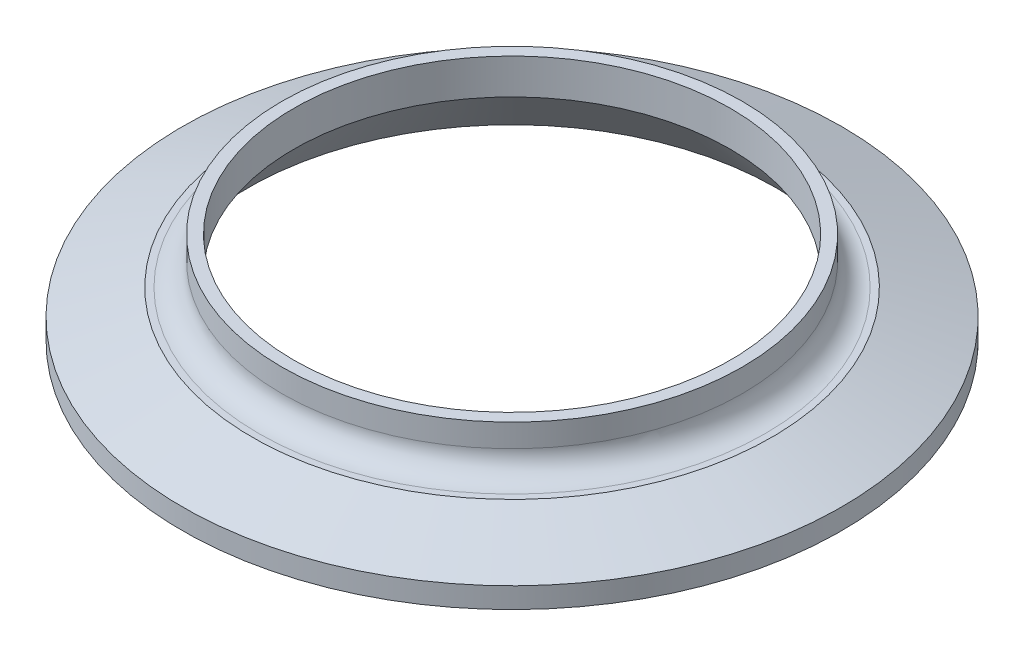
ISO-10303-21;
HEADER;
FILE_DESCRIPTION(('STEP AP214'),'2;1');
FILE_NAME('part.step','',(''),(''),'','','');
FILE_SCHEMA(('AUTOMOTIVE_DESIGN { 1 0 10303 214 1 1 1 1 }'));
ENDSEC;
DATA;
#1=APPLICATION_CONTEXT('core data for automotive mechanical design processes');
#2=APPLICATION_PROTOCOL_DEFINITION('international standard','automotive_design',2000,#1);
#3=PRODUCT_CONTEXT('',#1,'mechanical');
#4=PRODUCT('Part','Part','',(#3));
#5=PRODUCT_RELATED_PRODUCT_CATEGORY('part','',(#4));
#6=PRODUCT_DEFINITION_FORMATION('','',#4);
#7=PRODUCT_DEFINITION_CONTEXT('part definition',#1,'design');
#8=PRODUCT_DEFINITION('design','',#6,#7);
#9=PRODUCT_DEFINITION_SHAPE('','',#8);
#10=(LENGTH_UNIT() NAMED_UNIT(*) SI_UNIT(.MILLI.,.METRE.));
#11=(NAMED_UNIT(*) PLANE_ANGLE_UNIT() SI_UNIT($,.RADIAN.));
#12=(NAMED_UNIT(*) SI_UNIT($,.STERADIAN.) SOLID_ANGLE_UNIT());
#13=UNCERTAINTY_MEASURE_WITH_UNIT(LENGTH_MEASURE(1.E-05),#10,'distance_accuracy_value','');
#14=(GEOMETRIC_REPRESENTATION_CONTEXT(3) GLOBAL_UNCERTAINTY_ASSIGNED_CONTEXT((#13)) GLOBAL_UNIT_ASSIGNED_CONTEXT((#10,
#11,#12)) REPRESENTATION_CONTEXT('',''));
#15=CARTESIAN_POINT('',(0.,0.,0.));
#16=DIRECTION('',(0.,0.,1.));
#17=DIRECTION('',(1.,0.,0.));
#18=AXIS2_PLACEMENT_3D('',#15,#16,#17);
#19=CARTESIAN_POINT('',(-30.0990000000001,12.7000000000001,0.));
#20=DIRECTION('',(0.,-1.,0.));
#21=DIRECTION('',(0.,0.,-1.));
#22=AXIS2_PLACEMENT_3D('',#19,#20,#21);
#23=PLANE('',#22);
#24=CARTESIAN_POINT('',(0.,12.7,0.));
#25=DIRECTION('',(0.,-1.,0.));
#26=DIRECTION('',(0.,0.,-1.));
#27=AXIS2_PLACEMENT_3D('',#24,#25,#26);
#28=CIRCLE('',#27,31.75);
#29=CARTESIAN_POINT('',(0.,12.7,-31.7500000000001));
#30=VERTEX_POINT('',#29);
#31=EDGE_CURVE('E12',#30,#30,#28,.T.);
#32=ORIENTED_EDGE('',*,*,#31,.F.);
#33=EDGE_LOOP('',(#32));
#34=FACE_BOUND('',#33,.T.);
#35=CARTESIAN_POINT('',(0.,12.7,0.));
#36=DIRECTION('',(0.,-1.,0.));
#37=DIRECTION('',(0.,0.,-1.));
#38=AXIS2_PLACEMENT_3D('',#35,#36,#37);
#39=CIRCLE('',#38,30.099);
#40=CARTESIAN_POINT('',(0.,12.7,-30.0990000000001));
#41=VERTEX_POINT('',#40);
#42=EDGE_CURVE('E87',#41,#41,#39,.T.);
#43=ORIENTED_EDGE('',*,*,#42,.T.);
#44=EDGE_LOOP('',(#43));
#45=FACE_BOUND('',#44,.T.);
#46=ADVANCED_FACE('F38',(#34,#45),#23,.F.);
#47=CARTESIAN_POINT('',(0.,0.,0.));
#48=DIRECTION('',(0.,-1.,0.));
#49=DIRECTION('',(0.,0.,-1.));
#50=AXIS2_PLACEMENT_3D('',#47,#48,#49);
#51=CYLINDRICAL_SURFACE('',#50,31.75);
#52=CARTESIAN_POINT('',(0.,9.52500000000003,0.));
#53=DIRECTION('',(0.,-1.,0.));
#54=DIRECTION('',(0.,0.,-1.));
#55=AXIS2_PLACEMENT_3D('',#52,#53,#54);
#56=CIRCLE('',#55,31.75);
#57=CARTESIAN_POINT('',(0.,9.52500000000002,-31.7500000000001));
#58=VERTEX_POINT('',#57);
#59=EDGE_CURVE('E44',#58,#58,#56,.T.);
#60=ORIENTED_EDGE('',*,*,#59,.F.);
#61=EDGE_LOOP('',(#60));
#62=FACE_BOUND('',#61,.T.);
#63=ORIENTED_EDGE('',*,*,#31,.T.);
#64=EDGE_LOOP('',(#63));
#65=FACE_BOUND('',#64,.T.);
#66=ADVANCED_FACE('F166',(#62,#65),#51,.T.);
#67=CARTESIAN_POINT('',(0.,9.52500000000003,0.));
#68=DIRECTION('',(0.,-1.,0.));
#69=DIRECTION('',(0.,0.,-1.));
#70=AXIS2_PLACEMENT_3D('',#67,#68,#69);
#71=TOROIDAL_SURFACE('',#70,34.925,3.175);
#72=CARTESIAN_POINT('',(0.,6.35,0.));
#73=DIRECTION('',(0.,-1.,0.));
#74=DIRECTION('',(0.,0.,-1.));
#75=AXIS2_PLACEMENT_3D('',#72,#73,#74);
#76=CIRCLE('',#75,34.925);
#77=CARTESIAN_POINT('',(0.,6.35,-34.9250000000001));
#78=VERTEX_POINT('',#77);
#79=EDGE_CURVE('E48',#78,#78,#76,.T.);
#80=ORIENTED_EDGE('',*,*,#79,.F.);
#81=EDGE_LOOP('',(#80));
#82=FACE_BOUND('',#81,.T.);
#83=ORIENTED_EDGE('',*,*,#59,.T.);
#84=EDGE_LOOP('',(#83));
#85=FACE_BOUND('',#84,.T.);
#86=ADVANCED_FACE('F161',(#82,#85),#71,.F.);
#87=CARTESIAN_POINT('',(-34.9250000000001,6.35000000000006,0.));
#88=DIRECTION('',(0.,-1.,0.));
#89=DIRECTION('',(0.,0.,-1.));
#90=AXIS2_PLACEMENT_3D('',#87,#88,#89);
#91=PLANE('',#90);
#92=CARTESIAN_POINT('',(0.,6.35,0.));
#93=DIRECTION('',(0.,-1.,0.));
#94=DIRECTION('',(0.,0.,-1.));
#95=AXIS2_PLACEMENT_3D('',#92,#93,#94);
#96=CIRCLE('',#95,35.8228421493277);
#97=CARTESIAN_POINT('',(0.,6.35,-35.8228421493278));
#98=VERTEX_POINT('',#97);
#99=EDGE_CURVE('E52',#98,#98,#96,.T.);
#100=ORIENTED_EDGE('',*,*,#99,.F.);
#101=EDGE_LOOP('',(#100));
#102=FACE_BOUND('',#101,.T.);
#103=ORIENTED_EDGE('',*,*,#79,.T.);
#104=EDGE_LOOP('',(#103));
#105=FACE_BOUND('',#104,.T.);
#106=ADVANCED_FACE('F155',(#102,#105),#91,.F.);
#107=CARTESIAN_POINT('',(0.,6.35,0.));
#108=DIRECTION('',(0.,-1.,0.));
#109=DIRECTION('',(0.,0.,-1.));
#110=AXIS2_PLACEMENT_3D('',#107,#108,#109);
#111=CONICAL_SURFACE('',#110,35.8228421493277,1.22173047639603);
#112=CARTESIAN_POINT('',(0.,2.8448,0.));
#113=DIRECTION('',(0.,-1.,0.));
#114=DIRECTION('',(0.,0.,-1.));
#115=AXIS2_PLACEMENT_3D('',#112,#113,#114);
#116=CIRCLE('',#115,45.4533);
#117=CARTESIAN_POINT('',(0.,2.8448,-45.4533000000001));
#118=VERTEX_POINT('',#117);
#119=EDGE_CURVE('E57',#118,#118,#116,.T.);
#120=ORIENTED_EDGE('',*,*,#119,.F.);
#121=EDGE_LOOP('',(#120));
#122=FACE_BOUND('',#121,.T.);
#123=ORIENTED_EDGE('',*,*,#99,.T.);
#124=EDGE_LOOP('',(#123));
#125=FACE_BOUND('',#124,.T.);
#126=ADVANCED_FACE('F149',(#122,#125),#111,.T.);
#127=CARTESIAN_POINT('',(0.,0.,0.));
#128=DIRECTION('',(0.,-1.,0.));
#129=DIRECTION('',(0.,0.,-1.));
#130=AXIS2_PLACEMENT_3D('',#127,#128,#129);
#131=CYLINDRICAL_SURFACE('',#130,45.4533);
#132=CARTESIAN_POINT('',(0.,0.,0.));
#133=DIRECTION('',(0.,-1.,0.));
#134=DIRECTION('',(0.,0.,-1.));
#135=AXIS2_PLACEMENT_3D('',#132,#133,#134);
#136=CIRCLE('',#135,45.4533);
#137=CARTESIAN_POINT('',(0.,0.,-45.4533000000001));
#138=VERTEX_POINT('',#137);
#139=EDGE_CURVE('E60',#138,#138,#136,.T.);
#140=ORIENTED_EDGE('',*,*,#139,.F.);
#141=EDGE_LOOP('',(#140));
#142=FACE_BOUND('',#141,.T.);
#143=ORIENTED_EDGE('',*,*,#119,.T.);
#144=EDGE_LOOP('',(#143));
#145=FACE_BOUND('',#144,.T.);
#146=ADVANCED_FACE('F143',(#142,#145),#131,.T.);
#147=CARTESIAN_POINT('',(0.,0.,0.));
#148=DIRECTION('',(0.,-1.,0.));
#149=DIRECTION('',(0.,0.,-1.));
#150=AXIS2_PLACEMENT_3D('',#147,#148,#149);
#151=CONICAL_SURFACE('',#150,45.4533,1.56939586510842);
#152=CARTESIAN_POINT('',(0.,0.0025124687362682,0.));
#153=DIRECTION('',(0.,-1.,0.));
#154=DIRECTION('',(0.,0.,-1.));
#155=AXIS2_PLACEMENT_3D('',#152,#153,#154);
#156=CIRCLE('',#155,43.6592722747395);
#157=CARTESIAN_POINT('',(0.,0.00251246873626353,-43.6592722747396));
#158=VERTEX_POINT('',#157);
#159=EDGE_CURVE('E63',#158,#158,#156,.T.);
#160=ORIENTED_EDGE('',*,*,#159,.F.);
#161=EDGE_LOOP('',(#160));
#162=FACE_BOUND('',#161,.T.);
#163=ORIENTED_EDGE('',*,*,#139,.T.);
#164=EDGE_LOOP('',(#163));
#165=FACE_BOUND('',#164,.T.);
#166=ADVANCED_FACE('F137',(#162,#165),#151,.F.);
#167=CARTESIAN_POINT('',(0.,0.789912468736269,0.));
#168=DIRECTION('',(0.,-1.,0.));
#169=DIRECTION('',(0.,0.,-1.));
#170=AXIS2_PLACEMENT_3D('',#167,#168,#169);
#171=TOROIDAL_SURFACE('',#170,43.6592722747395,0.787399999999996);
#172=CARTESIAN_POINT('',(0.,0.482250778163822,0.));
#173=DIRECTION('',(0.,-1.,0.));
#174=DIRECTION('',(0.,0.,-1.));
#175=AXIS2_PLACEMENT_3D('',#172,#173,#174);
#176=CIRCLE('',#175,42.9344667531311);
#177=CARTESIAN_POINT('',(0.,0.482250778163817,-42.9344667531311));
#178=VERTEX_POINT('',#177);
#179=EDGE_CURVE('E66',#178,#178,#176,.T.);
#180=ORIENTED_EDGE('',*,*,#179,.F.);
#181=EDGE_LOOP('',(#180));
#182=FACE_BOUND('',#181,.T.);
#183=ORIENTED_EDGE('',*,*,#159,.T.);
#184=EDGE_LOOP('',(#183));
#185=FACE_BOUND('',#184,.T.);
#186=ADVANCED_FACE('F131',(#182,#185),#171,.T.);
#187=CARTESIAN_POINT('',(0.,0.482250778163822,0.));
#188=DIRECTION('',(0.,-1.,0.));
#189=DIRECTION('',(0.,0.,-1.));
#190=AXIS2_PLACEMENT_3D('',#187,#188,#189);
#191=CONICAL_SURFACE('',#190,42.9344667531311,0.401425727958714);
#192=CARTESIAN_POINT('',(0.,0.875367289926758,0.));
#193=DIRECTION('',(0.,-1.,0.));
#194=DIRECTION('',(0.,0.,-1.));
#195=AXIS2_PLACEMENT_3D('',#192,#193,#194);
#196=CIRCLE('',#195,42.7675986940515);
#197=CARTESIAN_POINT('',(0.,0.875367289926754,-42.7675986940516));
#198=VERTEX_POINT('',#197);
#199=EDGE_CURVE('E69',#198,#198,#196,.T.);
#200=ORIENTED_EDGE('',*,*,#199,.F.);
#201=EDGE_LOOP('',(#200));
#202=FACE_BOUND('',#201,.T.);
#203=ORIENTED_EDGE('',*,*,#179,.T.);
#204=EDGE_LOOP('',(#203));
#205=FACE_BOUND('',#204,.T.);
#206=ADVANCED_FACE('F125',(#202,#205),#191,.F.);
#207=CARTESIAN_POINT('',(0.,0.408912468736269,0.));
#208=DIRECTION('',(0.,-1.,0.));
#209=DIRECTION('',(0.,0.,-1.));
#210=AXIS2_PLACEMENT_3D('',#207,#208,#209);
#211=TOROIDAL_SURFACE('',#210,41.6687,1.19379999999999);
#212=CARTESIAN_POINT('',(0.,0.875367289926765,0.));
#213=DIRECTION('',(0.,-1.,0.));
#214=DIRECTION('',(0.,0.,-1.));
#215=AXIS2_PLACEMENT_3D('',#212,#213,#214);
#216=CIRCLE('',#215,40.5698013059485);
#217=CARTESIAN_POINT('',(0.,0.875367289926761,-40.5698013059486));
#218=VERTEX_POINT('',#217);
#219=EDGE_CURVE('E72',#218,#218,#216,.T.);
#220=ORIENTED_EDGE('',*,*,#219,.F.);
#221=EDGE_LOOP('',(#220));
#222=FACE_BOUND('',#221,.T.);
#223=ORIENTED_EDGE('',*,*,#199,.T.);
#224=EDGE_LOOP('',(#223));
#225=FACE_BOUND('',#224,.T.);
#226=ADVANCED_FACE('F119',(#222,#225),#211,.F.);
#227=CARTESIAN_POINT('',(0.,0.875367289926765,0.));
#228=DIRECTION('',(0.,1.,0.));
#229=DIRECTION('',(0.,0.,1.));
#230=AXIS2_PLACEMENT_3D('',#227,#228,#229);
#231=CONICAL_SURFACE('',#230,40.5698013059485,0.401425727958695);
#232=CARTESIAN_POINT('',(0.,0.482250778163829,0.));
#233=DIRECTION('',(0.,-1.,0.));
#234=DIRECTION('',(0.,0.,-1.));
#235=AXIS2_PLACEMENT_3D('',#232,#233,#234);
#236=CIRCLE('',#235,40.402933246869);
#237=CARTESIAN_POINT('',(0.,0.482250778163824,-40.402933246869));
#238=VERTEX_POINT('',#237);
#239=EDGE_CURVE('E75',#238,#238,#236,.T.);
#240=ORIENTED_EDGE('',*,*,#239,.F.);
#241=EDGE_LOOP('',(#240));
#242=FACE_BOUND('',#241,.T.);
#243=ORIENTED_EDGE('',*,*,#219,.T.);
#244=EDGE_LOOP('',(#243));
#245=FACE_BOUND('',#244,.T.);
#246=ADVANCED_FACE('F113',(#242,#245),#231,.T.);
#247=CARTESIAN_POINT('',(0.,0.789912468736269,0.));
#248=DIRECTION('',(0.,-1.,0.));
#249=DIRECTION('',(0.,0.,-1.));
#250=AXIS2_PLACEMENT_3D('',#247,#248,#249);
#251=TOROIDAL_SURFACE('',#250,39.6781277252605,0.787399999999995);
#252=CARTESIAN_POINT('',(0.,0.00251246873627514,0.));
#253=DIRECTION('',(0.,-1.,0.));
#254=DIRECTION('',(0.,0.,-1.));
#255=AXIS2_PLACEMENT_3D('',#252,#253,#254);
#256=CIRCLE('',#255,39.6781277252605);
#257=CARTESIAN_POINT('',(0.,0.00251246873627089,-39.6781277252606));
#258=VERTEX_POINT('',#257);
#259=EDGE_CURVE('E78',#258,#258,#256,.T.);
#260=ORIENTED_EDGE('',*,*,#259,.F.);
#261=EDGE_LOOP('',(#260));
#262=FACE_BOUND('',#261,.T.);
#263=ORIENTED_EDGE('',*,*,#239,.T.);
#264=EDGE_LOOP('',(#263));
#265=FACE_BOUND('',#264,.T.);
#266=ADVANCED_FACE('F107',(#262,#265),#251,.T.);
#267=CARTESIAN_POINT('',(0.,0.00251246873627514,0.));
#268=DIRECTION('',(0.,1.,0.));
#269=DIRECTION('',(0.,0.,1.));
#270=AXIS2_PLACEMENT_3D('',#267,#268,#269);
#271=CONICAL_SURFACE('',#270,39.6781277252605,1.57001826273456);
#272=CARTESIAN_POINT('',(0.,0.,0.));
#273=DIRECTION('',(0.,-1.,0.));
#274=DIRECTION('',(0.,0.,-1.));
#275=AXIS2_PLACEMENT_3D('',#272,#273,#274);
#276=CIRCLE('',#275,36.449);
#277=CARTESIAN_POINT('',(0.,0.,-36.4490000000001));
#278=VERTEX_POINT('',#277);
#279=EDGE_CURVE('E81',#278,#278,#276,.T.);
#280=ORIENTED_EDGE('',*,*,#279,.F.);
#281=EDGE_LOOP('',(#280));
#282=FACE_BOUND('',#281,.T.);
#283=ORIENTED_EDGE('',*,*,#259,.T.);
#284=EDGE_LOOP('',(#283));
#285=FACE_BOUND('',#284,.T.);
#286=ADVANCED_FACE('F101',(#282,#285),#271,.T.);
#287=CARTESIAN_POINT('',(0.,0.,0.));
#288=DIRECTION('',(0.,-1.,0.));
#289=DIRECTION('',(0.,0.,-1.));
#290=AXIS2_PLACEMENT_3D('',#287,#288,#289);
#291=CONICAL_SURFACE('',#290,36.449,0.682423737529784);
#292=CARTESIAN_POINT('',(0.,7.81367324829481,0.));
#293=DIRECTION('',(0.,-1.,0.));
#294=DIRECTION('',(0.,0.,-1.));
#295=AXIS2_PLACEMENT_3D('',#292,#293,#294);
#296=CIRCLE('',#295,30.099);
#297=CARTESIAN_POINT('',(0.,7.8136732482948,-30.0990000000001));
#298=VERTEX_POINT('',#297);
#299=EDGE_CURVE('E84',#298,#298,#296,.T.);
#300=ORIENTED_EDGE('',*,*,#299,.F.);
#301=EDGE_LOOP('',(#300));
#302=FACE_BOUND('',#301,.T.);
#303=ORIENTED_EDGE('',*,*,#279,.T.);
#304=EDGE_LOOP('',(#303));
#305=FACE_BOUND('',#304,.T.);
#306=ADVANCED_FACE('F95',(#302,#305),#291,.F.);
#307=CARTESIAN_POINT('',(0.,0.,0.));
#308=DIRECTION('',(0.,-1.,0.));
#309=DIRECTION('',(0.,0.,-1.));
#310=AXIS2_PLACEMENT_3D('',#307,#308,#309);
#311=CYLINDRICAL_SURFACE('',#310,30.099);
#312=ORIENTED_EDGE('',*,*,#42,.F.);
#313=EDGE_LOOP('',(#312));
#314=FACE_BOUND('',#313,.T.);
#315=ORIENTED_EDGE('',*,*,#299,.T.);
#316=EDGE_LOOP('',(#315));
#317=FACE_BOUND('',#316,.T.);
#318=ADVANCED_FACE('F92',(#314,#317),#311,.F.);
#319=CLOSED_SHELL('',(#46,#66,#86,#106,#126,#146,#166,#186,#206,#226,#246,#266,#286,#306,#318));
#320=MANIFOLD_SOLID_BREP('B2',#319);
#321=ADVANCED_BREP_SHAPE_REPRESENTATION('',(#18,#320),#14);
#322=SHAPE_DEFINITION_REPRESENTATION(#9,#321);
ENDSEC;
END-ISO-10303-21;
